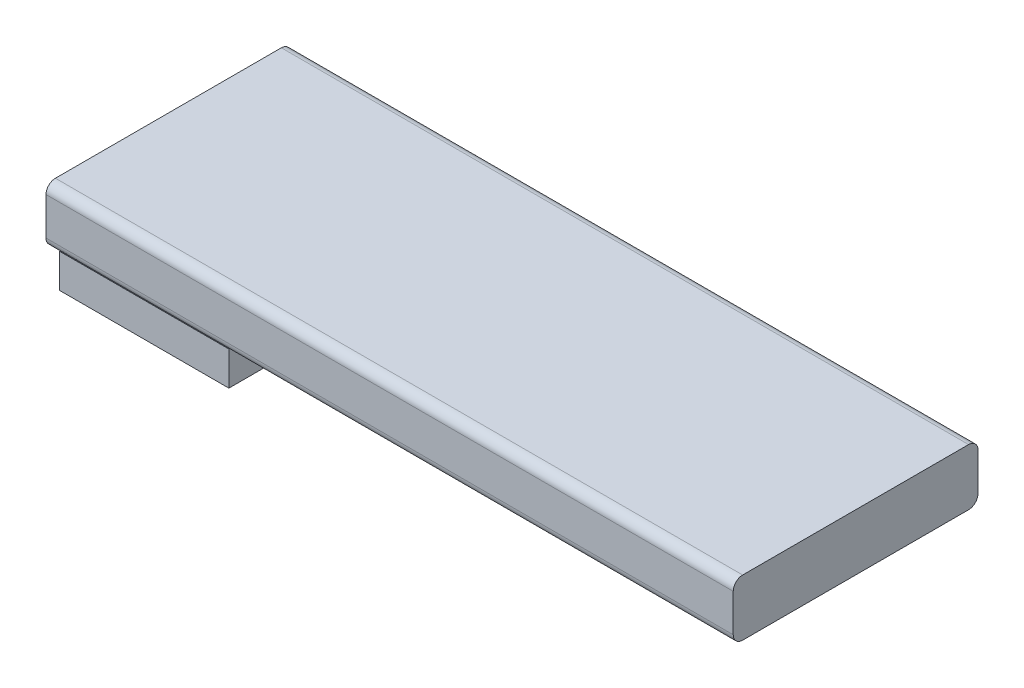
ISO-10303-21;
HEADER;
FILE_DESCRIPTION(('STEP AP214'),'2;1');
FILE_NAME('part.step','',(''),(''),'','','');
FILE_SCHEMA(('AUTOMOTIVE_DESIGN { 1 0 10303 214 1 1 1 1 }'));
ENDSEC;
DATA;
#1=APPLICATION_CONTEXT('core data for automotive mechanical design processes');
#2=APPLICATION_PROTOCOL_DEFINITION('international standard','automotive_design',2000,#1);
#3=PRODUCT_CONTEXT('',#1,'mechanical');
#4=PRODUCT('Part','Part','',(#3));
#5=PRODUCT_RELATED_PRODUCT_CATEGORY('part','',(#4));
#6=PRODUCT_DEFINITION_FORMATION('','',#4);
#7=PRODUCT_DEFINITION_CONTEXT('part definition',#1,'design');
#8=PRODUCT_DEFINITION('design','',#6,#7);
#9=PRODUCT_DEFINITION_SHAPE('','',#8);
#10=(LENGTH_UNIT() NAMED_UNIT(*) SI_UNIT(.MILLI.,.METRE.));
#11=(NAMED_UNIT(*) PLANE_ANGLE_UNIT() SI_UNIT($,.RADIAN.));
#12=(NAMED_UNIT(*) SI_UNIT($,.STERADIAN.) SOLID_ANGLE_UNIT());
#13=UNCERTAINTY_MEASURE_WITH_UNIT(LENGTH_MEASURE(1.E-05),#10,'distance_accuracy_value','');
#14=(GEOMETRIC_REPRESENTATION_CONTEXT(3) GLOBAL_UNCERTAINTY_ASSIGNED_CONTEXT((#13)) GLOBAL_UNIT_ASSIGNED_CONTEXT((#10,
#11,#12)) REPRESENTATION_CONTEXT('',''));
#15=CARTESIAN_POINT('',(0.,0.,0.));
#16=DIRECTION('',(0.,0.,1.));
#17=DIRECTION('',(1.,0.,0.));
#18=AXIS2_PLACEMENT_3D('',#15,#16,#17);
#19=CARTESIAN_POINT('',(73.,-3.,13.));
#20=DIRECTION('',(0.,1.,0.));
#21=DIRECTION('',(0.,0.,1.));
#22=AXIS2_PLACEMENT_3D('',#19,#20,#21);
#23=PLANE('',#22);
#24=DIRECTION('',(0.,0.,1.));
#25=VECTOR('',#24,1.);
#26=CARTESIAN_POINT('',(18.9272493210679,-3.,12.5));
#27=LINE('',#26,#25);
#28=CARTESIAN_POINT('',(18.9272493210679,-3.,-12.));
#29=VERTEX_POINT('',#28);
#30=CARTESIAN_POINT('',(18.9272493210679,-3.,12.));
#31=VERTEX_POINT('',#30);
#32=EDGE_CURVE('E203',#29,#31,#27,.T.);
#33=ORIENTED_EDGE('',*,*,#32,.F.);
#34=DIRECTION('',(-1.,0.,0.));
#35=VECTOR('',#34,1.);
#36=CARTESIAN_POINT('',(73.,-3.,-12.));
#37=LINE('',#36,#35);
#38=CARTESIAN_POINT('',(73.,-3.,-12.));
#39=VERTEX_POINT('',#38);
#40=EDGE_CURVE('E265',#29,#39,#37,.F.);
#41=ORIENTED_EDGE('',*,*,#40,.T.);
#42=DIRECTION('',(0.,0.,-1.));
#43=VECTOR('',#42,1.);
#44=CARTESIAN_POINT('',(73.,-3.,13.));
#45=LINE('',#44,#43);
#46=CARTESIAN_POINT('',(73.,-3.,12.));
#47=VERTEX_POINT('',#46);
#48=EDGE_CURVE('E235',#47,#39,#45,.T.);
#49=ORIENTED_EDGE('',*,*,#48,.F.);
#50=DIRECTION('',(-1.,0.,0.));
#51=VECTOR('',#50,1.);
#52=CARTESIAN_POINT('',(73.,-3.,12.));
#53=LINE('',#52,#51);
#54=EDGE_CURVE('E262',#47,#31,#53,.T.);
#55=ORIENTED_EDGE('',*,*,#54,.T.);
#56=EDGE_LOOP('',(#33,#41,#49,#55));
#57=FACE_BOUND('',#56,.T.);
#58=ADVANCED_FACE('F33',(#57),#23,.F.);
#59=DIRECTION('',(0.,0.,-1.));
#60=VECTOR('',#59,1.);
#61=CARTESIAN_POINT('',(0.927249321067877,-3.,12.5));
#62=LINE('',#61,#60);
#63=CARTESIAN_POINT('',(0.927249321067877,-3.,12.));
#64=VERTEX_POINT('',#63);
#65=CARTESIAN_POINT('',(0.927249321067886,-3.,-12.));
#66=VERTEX_POINT('',#65);
#67=EDGE_CURVE('E209',#64,#66,#62,.T.);
#68=ORIENTED_EDGE('',*,*,#67,.F.);
#69=CARTESIAN_POINT('',(0.,-3.,12.));
#70=VERTEX_POINT('',#69);
#71=EDGE_CURVE('E261',#64,#70,#53,.T.);
#72=ORIENTED_EDGE('',*,*,#71,.T.);
#73=DIRECTION('',(0.,0.,-1.));
#74=VECTOR('',#73,1.);
#75=CARTESIAN_POINT('',(0.,-3.,13.));
#76=LINE('',#75,#74);
#77=CARTESIAN_POINT('',(0.,-3.,-12.));
#78=VERTEX_POINT('',#77);
#79=EDGE_CURVE('E229',#70,#78,#76,.T.);
#80=ORIENTED_EDGE('',*,*,#79,.T.);
#81=EDGE_CURVE('E267',#78,#66,#37,.F.);
#82=ORIENTED_EDGE('',*,*,#81,.T.);
#83=EDGE_LOOP('',(#68,#72,#80,#82));
#84=FACE_BOUND('',#83,.T.);
#85=ADVANCED_FACE('F311',(#84),#23,.F.);
#86=CARTESIAN_POINT('',(73.,3.,-13.));
#87=DIRECTION('',(0.,0.,1.));
#88=DIRECTION('',(0.,-1.,0.));
#89=AXIS2_PLACEMENT_3D('',#86,#87,#88);
#90=PLANE('',#89);
#91=DIRECTION('',(0.,1.,0.));
#92=VECTOR('',#91,1.);
#93=CARTESIAN_POINT('',(73.,3.,-13.));
#94=LINE('',#93,#92);
#95=CARTESIAN_POINT('',(73.,-2.,-13.));
#96=VERTEX_POINT('',#95);
#97=CARTESIAN_POINT('',(73.,2.,-13.));
#98=VERTEX_POINT('',#97);
#99=EDGE_CURVE('E225',#96,#98,#94,.T.);
#100=ORIENTED_EDGE('',*,*,#99,.F.);
#101=DIRECTION('',(-1.,0.,0.));
#102=VECTOR('',#101,1.);
#103=CARTESIAN_POINT('',(73.,-2.,-13.));
#104=LINE('',#103,#102);
#105=CARTESIAN_POINT('',(0.,-2.,-13.));
#106=VERTEX_POINT('',#105);
#107=EDGE_CURVE('E250',#96,#106,#104,.T.);
#108=ORIENTED_EDGE('',*,*,#107,.T.);
#109=DIRECTION('',(0.,1.,0.));
#110=VECTOR('',#109,1.);
#111=CARTESIAN_POINT('',(0.,3.,-13.));
#112=LINE('',#111,#110);
#113=CARTESIAN_POINT('',(0.,2.,-13.));
#114=VERTEX_POINT('',#113);
#115=EDGE_CURVE('E224',#106,#114,#112,.T.);
#116=ORIENTED_EDGE('',*,*,#115,.T.);
#117=DIRECTION('',(-1.,0.,0.));
#118=VECTOR('',#117,1.);
#119=CARTESIAN_POINT('',(73.,2.,-13.));
#120=LINE('',#119,#118);
#121=EDGE_CURVE('E238',#114,#98,#120,.F.);
#122=ORIENTED_EDGE('',*,*,#121,.T.);
#123=EDGE_LOOP('',(#100,#108,#116,#122));
#124=FACE_BOUND('',#123,.T.);
#125=ADVANCED_FACE('F317',(#124),#90,.F.);
#126=CARTESIAN_POINT('',(73.,3.,13.));
#127=DIRECTION('',(0.,-1.,0.));
#128=DIRECTION('',(0.,0.,-1.));
#129=AXIS2_PLACEMENT_3D('',#126,#127,#128);
#130=PLANE('',#129);
#131=DIRECTION('',(0.,0.,1.));
#132=VECTOR('',#131,1.);
#133=CARTESIAN_POINT('',(73.,3.,13.));
#134=LINE('',#133,#132);
#135=CARTESIAN_POINT('',(73.,3.,-12.));
#136=VERTEX_POINT('',#135);
#137=CARTESIAN_POINT('',(73.,3.,12.));
#138=VERTEX_POINT('',#137);
#139=EDGE_CURVE('E228',#136,#138,#134,.T.);
#140=ORIENTED_EDGE('',*,*,#139,.F.);
#141=DIRECTION('',(-1.,0.,0.));
#142=VECTOR('',#141,1.);
#143=CARTESIAN_POINT('',(73.,3.,-12.));
#144=LINE('',#143,#142);
#145=CARTESIAN_POINT('',(0.,3.,-12.));
#146=VERTEX_POINT('',#145);
#147=EDGE_CURVE('E280',#136,#146,#144,.T.);
#148=ORIENTED_EDGE('',*,*,#147,.T.);
#149=DIRECTION('',(0.,0.,1.));
#150=VECTOR('',#149,1.);
#151=CARTESIAN_POINT('',(0.,3.,13.));
#152=LINE('',#151,#150);
#153=CARTESIAN_POINT('',(0.,3.,12.));
#154=VERTEX_POINT('',#153);
#155=EDGE_CURVE('E241',#146,#154,#152,.T.);
#156=ORIENTED_EDGE('',*,*,#155,.T.);
#157=DIRECTION('',(-1.,0.,0.));
#158=VECTOR('',#157,1.);
#159=CARTESIAN_POINT('',(73.,3.,12.));
#160=LINE('',#159,#158);
#161=EDGE_CURVE('E278',#154,#138,#160,.F.);
#162=ORIENTED_EDGE('',*,*,#161,.T.);
#163=EDGE_LOOP('',(#140,#148,#156,#162));
#164=FACE_BOUND('',#163,.T.);
#165=ADVANCED_FACE('F328',(#164),#130,.F.);
#166=CARTESIAN_POINT('',(73.,3.,13.));
#167=DIRECTION('',(0.,0.,-1.));
#168=DIRECTION('',(-1.,0.,0.));
#169=AXIS2_PLACEMENT_3D('',#166,#167,#168);
#170=PLANE('',#169);
#171=DIRECTION('',(0.,-1.,0.));
#172=VECTOR('',#171,1.);
#173=CARTESIAN_POINT('',(73.,3.,13.));
#174=LINE('',#173,#172);
#175=CARTESIAN_POINT('',(73.,2.,13.));
#176=VERTEX_POINT('',#175);
#177=CARTESIAN_POINT('',(73.,-2.,13.));
#178=VERTEX_POINT('',#177);
#179=EDGE_CURVE('E232',#176,#178,#174,.T.);
#180=ORIENTED_EDGE('',*,*,#179,.F.);
#181=DIRECTION('',(-1.,0.,0.));
#182=VECTOR('',#181,1.);
#183=CARTESIAN_POINT('',(73.,2.,13.));
#184=LINE('',#183,#182);
#185=CARTESIAN_POINT('',(0.,2.,13.));
#186=VERTEX_POINT('',#185);
#187=EDGE_CURVE('E285',#176,#186,#184,.T.);
#188=ORIENTED_EDGE('',*,*,#187,.T.);
#189=DIRECTION('',(0.,-1.,0.));
#190=VECTOR('',#189,1.);
#191=CARTESIAN_POINT('',(0.,3.,13.));
#192=LINE('',#191,#190);
#193=CARTESIAN_POINT('',(0.,-2.,13.));
#194=VERTEX_POINT('',#193);
#195=EDGE_CURVE('E244',#186,#194,#192,.T.);
#196=ORIENTED_EDGE('',*,*,#195,.T.);
#197=DIRECTION('',(-1.,0.,0.));
#198=VECTOR('',#197,1.);
#199=CARTESIAN_POINT('',(73.,-2.,13.));
#200=LINE('',#199,#198);
#201=EDGE_CURVE('E283',#194,#178,#200,.F.);
#202=ORIENTED_EDGE('',*,*,#201,.T.);
#203=EDGE_LOOP('',(#180,#188,#196,#202));
#204=FACE_BOUND('',#203,.T.);
#205=ADVANCED_FACE('F324',(#204),#170,.F.);
#206=CARTESIAN_POINT('',(73.,0.,0.));
#207=DIRECTION('',(1.,0.,0.));
#208=DIRECTION('',(0.,0.,-1.));
#209=AXIS2_PLACEMENT_3D('',#206,#207,#208);
#210=PLANE('',#209);
#211=ORIENTED_EDGE('',*,*,#48,.T.);
#212=CARTESIAN_POINT('',(73.,-2.,-12.));
#213=DIRECTION('',(1.,0.,0.));
#214=DIRECTION('',(0.,0.,-1.));
#215=AXIS2_PLACEMENT_3D('',#212,#213,#214);
#216=CIRCLE('',#215,1.);
#217=EDGE_CURVE('E276',#39,#96,#216,.T.);
#218=ORIENTED_EDGE('',*,*,#217,.T.);
#219=ORIENTED_EDGE('',*,*,#99,.T.);
#220=CARTESIAN_POINT('',(73.,2.,-12.));
#221=DIRECTION('',(1.,0.,0.));
#222=DIRECTION('',(0.,0.,-1.));
#223=AXIS2_PLACEMENT_3D('',#220,#221,#222);
#224=CIRCLE('',#223,1.);
#225=EDGE_CURVE('E274',#98,#136,#224,.T.);
#226=ORIENTED_EDGE('',*,*,#225,.T.);
#227=ORIENTED_EDGE('',*,*,#139,.T.);
#228=CARTESIAN_POINT('',(73.,2.,12.));
#229=DIRECTION('',(1.,0.,0.));
#230=DIRECTION('',(0.,0.,-1.));
#231=AXIS2_PLACEMENT_3D('',#228,#229,#230);
#232=CIRCLE('',#231,1.);
#233=EDGE_CURVE('E272',#138,#176,#232,.T.);
#234=ORIENTED_EDGE('',*,*,#233,.T.);
#235=ORIENTED_EDGE('',*,*,#179,.T.);
#236=CARTESIAN_POINT('',(73.,-2.,12.));
#237=DIRECTION('',(1.,0.,0.));
#238=DIRECTION('',(0.,0.,-1.));
#239=AXIS2_PLACEMENT_3D('',#236,#237,#238);
#240=CIRCLE('',#239,1.);
#241=EDGE_CURVE('E270',#178,#47,#240,.T.);
#242=ORIENTED_EDGE('',*,*,#241,.T.);
#243=EDGE_LOOP('',(#211,#218,#219,#226,#227,#234,#235,#242));
#244=FACE_BOUND('',#243,.T.);
#245=ADVANCED_FACE('F327',(#244),#210,.T.);
#246=CARTESIAN_POINT('',(0.,0.,0.));
#247=DIRECTION('',(1.,0.,0.));
#248=DIRECTION('',(0.,0.,-1.));
#249=AXIS2_PLACEMENT_3D('',#246,#247,#248);
#250=PLANE('',#249);
#251=ORIENTED_EDGE('',*,*,#115,.F.);
#252=CARTESIAN_POINT('',(0.,-2.,-12.));
#253=DIRECTION('',(1.,0.,0.));
#254=DIRECTION('',(0.,0.,-1.));
#255=AXIS2_PLACEMENT_3D('',#252,#253,#254);
#256=CIRCLE('',#255,1.);
#257=EDGE_CURVE('E259',#106,#78,#256,.F.);
#258=ORIENTED_EDGE('',*,*,#257,.T.);
#259=ORIENTED_EDGE('',*,*,#79,.F.);
#260=CARTESIAN_POINT('',(0.,-2.,12.));
#261=DIRECTION('',(1.,0.,0.));
#262=DIRECTION('',(0.,0.,-1.));
#263=AXIS2_PLACEMENT_3D('',#260,#261,#262);
#264=CIRCLE('',#263,1.);
#265=EDGE_CURVE('E253',#70,#194,#264,.F.);
#266=ORIENTED_EDGE('',*,*,#265,.T.);
#267=ORIENTED_EDGE('',*,*,#195,.F.);
#268=CARTESIAN_POINT('',(0.,2.,12.));
#269=DIRECTION('',(1.,0.,0.));
#270=DIRECTION('',(0.,0.,-1.));
#271=AXIS2_PLACEMENT_3D('',#268,#269,#270);
#272=CIRCLE('',#271,1.);
#273=EDGE_CURVE('E255',#186,#154,#272,.F.);
#274=ORIENTED_EDGE('',*,*,#273,.T.);
#275=ORIENTED_EDGE('',*,*,#155,.F.);
#276=CARTESIAN_POINT('',(0.,2.,-12.));
#277=DIRECTION('',(1.,0.,0.));
#278=DIRECTION('',(0.,0.,-1.));
#279=AXIS2_PLACEMENT_3D('',#276,#277,#278);
#280=CIRCLE('',#279,1.);
#281=EDGE_CURVE('E257',#146,#114,#280,.F.);
#282=ORIENTED_EDGE('',*,*,#281,.T.);
#283=EDGE_LOOP('',(#251,#258,#259,#266,#267,#274,#275,#282));
#284=FACE_BOUND('',#283,.T.);
#285=ADVANCED_FACE('F322',(#284),#250,.F.);
#286=CARTESIAN_POINT('',(73.,-2.,-12.));
#287=DIRECTION('',(-1.,0.,0.));
#288=DIRECTION('',(0.,0.,1.));
#289=AXIS2_PLACEMENT_3D('',#286,#287,#288);
#290=CYLINDRICAL_SURFACE('',#289,1.);
#291=ORIENTED_EDGE('',*,*,#217,.F.);
#292=ORIENTED_EDGE('',*,*,#40,.F.);
#293=DIRECTION('',(-1.,0.,0.));
#294=VECTOR('',#293,1.);
#295=CARTESIAN_POINT('',(73.,-3.,-12.));
#296=LINE('',#295,#294);
#297=EDGE_CURVE('E222',#66,#29,#296,.F.);
#298=ORIENTED_EDGE('',*,*,#297,.F.);
#299=ORIENTED_EDGE('',*,*,#81,.F.);
#300=ORIENTED_EDGE('',*,*,#257,.F.);
#301=ORIENTED_EDGE('',*,*,#107,.F.);
#302=EDGE_LOOP('',(#291,#292,#298,#299,#300,#301));
#303=FACE_BOUND('',#302,.T.);
#304=ADVANCED_FACE('F336',(#303),#290,.T.);
#305=CARTESIAN_POINT('',(73.,2.,-12.));
#306=DIRECTION('',(-1.,0.,0.));
#307=DIRECTION('',(0.,0.,1.));
#308=AXIS2_PLACEMENT_3D('',#305,#306,#307);
#309=CYLINDRICAL_SURFACE('',#308,1.);
#310=ORIENTED_EDGE('',*,*,#225,.F.);
#311=ORIENTED_EDGE('',*,*,#121,.F.);
#312=ORIENTED_EDGE('',*,*,#281,.F.);
#313=ORIENTED_EDGE('',*,*,#147,.F.);
#314=EDGE_LOOP('',(#310,#311,#312,#313));
#315=FACE_BOUND('',#314,.T.);
#316=ADVANCED_FACE('F339',(#315),#309,.T.);
#317=CARTESIAN_POINT('',(73.,2.,12.));
#318=DIRECTION('',(-1.,0.,0.));
#319=DIRECTION('',(0.,0.,1.));
#320=AXIS2_PLACEMENT_3D('',#317,#318,#319);
#321=CYLINDRICAL_SURFACE('',#320,1.);
#322=ORIENTED_EDGE('',*,*,#233,.F.);
#323=ORIENTED_EDGE('',*,*,#161,.F.);
#324=ORIENTED_EDGE('',*,*,#273,.F.);
#325=ORIENTED_EDGE('',*,*,#187,.F.);
#326=EDGE_LOOP('',(#322,#323,#324,#325));
#327=FACE_BOUND('',#326,.T.);
#328=ADVANCED_FACE('F342',(#327),#321,.T.);
#329=CARTESIAN_POINT('',(73.,-2.,12.));
#330=DIRECTION('',(-1.,0.,0.));
#331=DIRECTION('',(0.,0.,1.));
#332=AXIS2_PLACEMENT_3D('',#329,#330,#331);
#333=CYLINDRICAL_SURFACE('',#332,1.);
#334=ORIENTED_EDGE('',*,*,#241,.F.);
#335=ORIENTED_EDGE('',*,*,#201,.F.);
#336=ORIENTED_EDGE('',*,*,#265,.F.);
#337=ORIENTED_EDGE('',*,*,#71,.F.);
#338=EDGE_CURVE('E266',#31,#64,#53,.T.);
#339=ORIENTED_EDGE('',*,*,#338,.F.);
#340=ORIENTED_EDGE('',*,*,#54,.F.);
#341=EDGE_LOOP('',(#334,#335,#336,#337,#339,#340));
#342=FACE_BOUND('',#341,.T.);
#343=ADVANCED_FACE('F35',(#342),#333,.T.);
#344=CARTESIAN_POINT('',(0.,-3.,0.));
#345=DIRECTION('',(0.,-1.,0.));
#346=DIRECTION('',(0.,0.,-1.));
#347=AXIS2_PLACEMENT_3D('',#344,#345,#346);
#348=PLANE('',#347);
#349=ORIENTED_EDGE('',*,*,#297,.T.);
#350=CARTESIAN_POINT('',(18.9272493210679,-3.,-12.5));
#351=VERTEX_POINT('',#350);
#352=EDGE_CURVE('E199',#351,#29,#27,.T.);
#353=ORIENTED_EDGE('',*,*,#352,.F.);
#354=DIRECTION('',(1.,0.,0.));
#355=VECTOR('',#354,1.);
#356=CARTESIAN_POINT('',(0.92724932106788,-3.,-12.5));
#357=LINE('',#356,#355);
#358=CARTESIAN_POINT('',(0.92724932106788,-3.,-12.5));
#359=VERTEX_POINT('',#358);
#360=EDGE_CURVE('E191',#359,#351,#357,.T.);
#361=ORIENTED_EDGE('',*,*,#360,.F.);
#362=EDGE_CURVE('E205',#66,#359,#62,.T.);
#363=ORIENTED_EDGE('',*,*,#362,.F.);
#364=EDGE_LOOP('',(#349,#353,#361,#363));
#365=FACE_BOUND('',#364,.T.);
#366=ADVANCED_FACE('F306',(#365),#348,.F.);
#367=CARTESIAN_POINT('',(18.9272493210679,-6.6,12.5));
#368=DIRECTION('',(-1.,0.,0.));
#369=DIRECTION('',(0.,0.,1.));
#370=AXIS2_PLACEMENT_3D('',#367,#368,#369);
#371=PLANE('',#370);
#372=ORIENTED_EDGE('',*,*,#352,.T.);
#373=ORIENTED_EDGE('',*,*,#32,.T.);
#374=CARTESIAN_POINT('',(18.9272493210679,-3.,12.5));
#375=VERTEX_POINT('',#374);
#376=EDGE_CURVE('E185',#31,#375,#27,.T.);
#377=ORIENTED_EDGE('',*,*,#376,.T.);
#378=DIRECTION('',(0.,1.,0.));
#379=VECTOR('',#378,1.);
#380=CARTESIAN_POINT('',(18.9272493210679,-6.6,12.5));
#381=LINE('',#380,#379);
#382=CARTESIAN_POINT('',(18.9272493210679,-6.6,12.5));
#383=VERTEX_POINT('',#382);
#384=EDGE_CURVE('E219',#383,#375,#381,.T.);
#385=ORIENTED_EDGE('',*,*,#384,.F.);
#386=DIRECTION('',(0.,0.,1.));
#387=VECTOR('',#386,1.);
#388=CARTESIAN_POINT('',(18.9272493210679,-6.6,12.5));
#389=LINE('',#388,#387);
#390=CARTESIAN_POINT('',(18.9272493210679,-6.6,-12.5));
#391=VERTEX_POINT('',#390);
#392=EDGE_CURVE('E187',#391,#383,#389,.T.);
#393=ORIENTED_EDGE('',*,*,#392,.F.);
#394=DIRECTION('',(0.,1.,0.));
#395=VECTOR('',#394,1.);
#396=CARTESIAN_POINT('',(18.9272493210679,-6.6,-12.5));
#397=LINE('',#396,#395);
#398=EDGE_CURVE('E198',#391,#351,#397,.T.);
#399=ORIENTED_EDGE('',*,*,#398,.T.);
#400=EDGE_LOOP('',(#372,#373,#377,#385,#393,#399));
#401=FACE_BOUND('',#400,.T.);
#402=ADVANCED_FACE('F371',(#401),#371,.F.);
#403=CARTESIAN_POINT('',(0.927249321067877,-6.6,12.5));
#404=DIRECTION('',(0.,0.,-1.));
#405=DIRECTION('',(-1.,0.,0.));
#406=AXIS2_PLACEMENT_3D('',#403,#404,#405);
#407=PLANE('',#406);
#408=DIRECTION('',(-1.,0.,0.));
#409=VECTOR('',#408,1.);
#410=CARTESIAN_POINT('',(0.927249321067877,-3.,12.5));
#411=LINE('',#410,#409);
#412=CARTESIAN_POINT('',(0.927249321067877,-3.,12.5));
#413=VERTEX_POINT('',#412);
#414=EDGE_CURVE('E202',#375,#413,#411,.T.);
#415=ORIENTED_EDGE('',*,*,#414,.T.);
#416=DIRECTION('',(0.,1.,0.));
#417=VECTOR('',#416,1.);
#418=CARTESIAN_POINT('',(0.927249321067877,-6.6,12.5));
#419=LINE('',#418,#417);
#420=CARTESIAN_POINT('',(0.927249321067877,-6.6,12.5));
#421=VERTEX_POINT('',#420);
#422=EDGE_CURVE('E216',#421,#413,#419,.T.);
#423=ORIENTED_EDGE('',*,*,#422,.F.);
#424=DIRECTION('',(-1.,0.,0.));
#425=VECTOR('',#424,1.);
#426=CARTESIAN_POINT('',(0.927249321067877,-6.6,12.5));
#427=LINE('',#426,#425);
#428=EDGE_CURVE('E190',#383,#421,#427,.T.);
#429=ORIENTED_EDGE('',*,*,#428,.F.);
#430=ORIENTED_EDGE('',*,*,#384,.T.);
#431=EDGE_LOOP('',(#415,#423,#429,#430));
#432=FACE_BOUND('',#431,.T.);
#433=ADVANCED_FACE('F384',(#432),#407,.F.);
#434=CARTESIAN_POINT('',(0.927249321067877,-6.6,12.5));
#435=DIRECTION('',(1.,0.,0.));
#436=DIRECTION('',(0.,0.,-1.));
#437=AXIS2_PLACEMENT_3D('',#434,#435,#436);
#438=PLANE('',#437);
#439=EDGE_CURVE('E206',#413,#64,#62,.T.);
#440=ORIENTED_EDGE('',*,*,#439,.T.);
#441=ORIENTED_EDGE('',*,*,#67,.T.);
#442=ORIENTED_EDGE('',*,*,#362,.T.);
#443=DIRECTION('',(0.,1.,0.));
#444=VECTOR('',#443,1.);
#445=CARTESIAN_POINT('',(0.92724932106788,-6.6,-12.5));
#446=LINE('',#445,#444);
#447=CARTESIAN_POINT('',(0.92724932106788,-6.6,-12.5));
#448=VERTEX_POINT('',#447);
#449=EDGE_CURVE('E213',#448,#359,#446,.T.);
#450=ORIENTED_EDGE('',*,*,#449,.F.);
#451=DIRECTION('',(0.,0.,-1.));
#452=VECTOR('',#451,1.);
#453=CARTESIAN_POINT('',(0.927249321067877,-6.6,12.5));
#454=LINE('',#453,#452);
#455=EDGE_CURVE('E193',#421,#448,#454,.T.);
#456=ORIENTED_EDGE('',*,*,#455,.F.);
#457=ORIENTED_EDGE('',*,*,#422,.T.);
#458=EDGE_LOOP('',(#440,#441,#442,#450,#456,#457));
#459=FACE_BOUND('',#458,.T.);
#460=ADVANCED_FACE('F307',(#459),#438,.F.);
#461=CARTESIAN_POINT('',(0.92724932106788,-6.6,-12.5));
#462=DIRECTION('',(0.,0.,1.));
#463=DIRECTION('',(1.,0.,0.));
#464=AXIS2_PLACEMENT_3D('',#461,#462,#463);
#465=PLANE('',#464);
#466=ORIENTED_EDGE('',*,*,#360,.T.);
#467=ORIENTED_EDGE('',*,*,#398,.F.);
#468=DIRECTION('',(1.,0.,0.));
#469=VECTOR('',#468,1.);
#470=CARTESIAN_POINT('',(0.92724932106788,-6.6,-12.5));
#471=LINE('',#470,#469);
#472=CARTESIAN_POINT('',(13.9272493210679,-6.6,-12.5));
#473=VERTEX_POINT('',#472);
#474=EDGE_CURVE('E195',#473,#391,#471,.T.);
#475=ORIENTED_EDGE('',*,*,#474,.F.);
#476=DIRECTION('',(0.,-1.,0.));
#477=VECTOR('',#476,1.);
#478=CARTESIAN_POINT('',(13.9272493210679,-3.,-12.5));
#479=LINE('',#478,#477);
#480=CARTESIAN_POINT('',(13.9272493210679,-8.,-12.5));
#481=VERTEX_POINT('',#480);
#482=EDGE_CURVE('E180',#473,#481,#479,.T.);
#483=ORIENTED_EDGE('',*,*,#482,.T.);
#484=DIRECTION('',(-1.,0.,0.));
#485=VECTOR('',#484,1.);
#486=CARTESIAN_POINT('',(13.9272493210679,-8.,-12.5));
#487=LINE('',#486,#485);
#488=CARTESIAN_POINT('',(5.42724932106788,-8.,-12.5));
#489=VERTEX_POINT('',#488);
#490=EDGE_CURVE('E170',#481,#489,#487,.T.);
#491=ORIENTED_EDGE('',*,*,#490,.T.);
#492=DIRECTION('',(0.,1.,0.));
#493=VECTOR('',#492,1.);
#494=CARTESIAN_POINT('',(5.42724932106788,-3.,-12.5));
#495=LINE('',#494,#493);
#496=CARTESIAN_POINT('',(5.42724932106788,-6.6,-12.5));
#497=VERTEX_POINT('',#496);
#498=EDGE_CURVE('E164',#489,#497,#495,.T.);
#499=ORIENTED_EDGE('',*,*,#498,.T.);
#500=EDGE_CURVE('E196',#448,#497,#471,.T.);
#501=ORIENTED_EDGE('',*,*,#500,.F.);
#502=ORIENTED_EDGE('',*,*,#449,.T.);
#503=EDGE_LOOP('',(#466,#467,#475,#483,#491,#499,#501,#502));
#504=FACE_BOUND('',#503,.T.);
#505=ADVANCED_FACE('F293',(#504),#465,.F.);
#506=CARTESIAN_POINT('',(0.,-6.6,0.));
#507=DIRECTION('',(0.,-1.,0.));
#508=DIRECTION('',(0.,0.,-1.));
#509=AXIS2_PLACEMENT_3D('',#506,#507,#508);
#510=PLANE('',#509);
#511=DIRECTION('',(0.,0.,1.));
#512=VECTOR('',#511,1.);
#513=CARTESIAN_POINT('',(13.9272493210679,-6.6,0.));
#514=LINE('',#513,#512);
#515=CARTESIAN_POINT('',(13.9272493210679,-6.6,-2.5));
#516=VERTEX_POINT('',#515);
#517=EDGE_CURVE('E11',#473,#516,#514,.T.);
#518=ORIENTED_EDGE('',*,*,#517,.F.);
#519=ORIENTED_EDGE('',*,*,#474,.T.);
#520=ORIENTED_EDGE('',*,*,#392,.T.);
#521=ORIENTED_EDGE('',*,*,#428,.T.);
#522=ORIENTED_EDGE('',*,*,#455,.T.);
#523=ORIENTED_EDGE('',*,*,#500,.T.);
#524=DIRECTION('',(0.,0.,-1.));
#525=VECTOR('',#524,1.);
#526=CARTESIAN_POINT('',(5.42724932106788,-6.6,0.));
#527=LINE('',#526,#525);
#528=CARTESIAN_POINT('',(5.42724932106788,-6.6,-2.5));
#529=VERTEX_POINT('',#528);
#530=EDGE_CURVE('E41',#529,#497,#527,.T.);
#531=ORIENTED_EDGE('',*,*,#530,.F.);
#532=DIRECTION('',(1.,0.,0.));
#533=VECTOR('',#532,1.);
#534=CARTESIAN_POINT('',(0.,-6.6,-2.5));
#535=LINE('',#534,#533);
#536=EDGE_CURVE('E48',#529,#516,#535,.T.);
#537=ORIENTED_EDGE('',*,*,#536,.T.);
#538=EDGE_LOOP('',(#518,#519,#520,#521,#522,#523,#531,#537));
#539=FACE_BOUND('',#538,.T.);
#540=ADVANCED_FACE('F296',(#539),#510,.T.);
#541=ORIENTED_EDGE('',*,*,#338,.T.);
#542=ORIENTED_EDGE('',*,*,#439,.F.);
#543=ORIENTED_EDGE('',*,*,#414,.F.);
#544=ORIENTED_EDGE('',*,*,#376,.F.);
#545=EDGE_LOOP('',(#541,#542,#543,#544));
#546=FACE_BOUND('',#545,.T.);
#547=ADVANCED_FACE('F298',(#546),#348,.F.);
#548=CARTESIAN_POINT('',(13.9272493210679,-3.,-2.5));
#549=DIRECTION('',(1.,0.,0.));
#550=DIRECTION('',(0.,1.,0.));
#551=AXIS2_PLACEMENT_3D('',#548,#549,#550);
#552=PLANE('',#551);
#553=ORIENTED_EDGE('',*,*,#482,.F.);
#554=ORIENTED_EDGE('',*,*,#517,.T.);
#555=DIRECTION('',(0.,-1.,0.));
#556=VECTOR('',#555,1.);
#557=CARTESIAN_POINT('',(13.9272493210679,-3.,-2.5));
#558=LINE('',#557,#556);
#559=CARTESIAN_POINT('',(13.9272493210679,-8.,-2.5));
#560=VERTEX_POINT('',#559);
#561=EDGE_CURVE('E155',#516,#560,#558,.T.);
#562=ORIENTED_EDGE('',*,*,#561,.T.);
#563=DIRECTION('',(0.,0.,-1.));
#564=VECTOR('',#563,1.);
#565=CARTESIAN_POINT('',(13.9272493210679,-8.,-2.5));
#566=LINE('',#565,#564);
#567=EDGE_CURVE('E159',#560,#481,#566,.T.);
#568=ORIENTED_EDGE('',*,*,#567,.T.);
#569=EDGE_LOOP('',(#553,#554,#562,#568));
#570=FACE_BOUND('',#569,.T.);
#571=ADVANCED_FACE('F158',(#570),#552,.T.);
#572=CARTESIAN_POINT('',(5.42724932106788,-3.,-2.5));
#573=DIRECTION('',(-1.,0.,0.));
#574=DIRECTION('',(0.,-1.,0.));
#575=AXIS2_PLACEMENT_3D('',#572,#573,#574);
#576=PLANE('',#575);
#577=DIRECTION('',(0.,1.,0.));
#578=VECTOR('',#577,1.);
#579=CARTESIAN_POINT('',(5.42724932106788,-3.,-2.5));
#580=LINE('',#579,#578);
#581=CARTESIAN_POINT('',(5.42724932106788,-8.,-2.5));
#582=VERTEX_POINT('',#581);
#583=EDGE_CURVE('E172',#582,#529,#580,.T.);
#584=ORIENTED_EDGE('',*,*,#583,.T.);
#585=ORIENTED_EDGE('',*,*,#530,.T.);
#586=ORIENTED_EDGE('',*,*,#498,.F.);
#587=DIRECTION('',(0.,0.,-1.));
#588=VECTOR('',#587,1.);
#589=CARTESIAN_POINT('',(5.42724932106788,-8.,-2.5));
#590=LINE('',#589,#588);
#591=EDGE_CURVE('E171',#582,#489,#590,.T.);
#592=ORIENTED_EDGE('',*,*,#591,.F.);
#593=EDGE_LOOP('',(#584,#585,#586,#592));
#594=FACE_BOUND('',#593,.T.);
#595=ADVANCED_FACE('F290',(#594),#576,.T.);
#596=CARTESIAN_POINT('',(13.9272493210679,-8.,-2.5));
#597=DIRECTION('',(0.,-1.,0.));
#598=DIRECTION('',(1.,0.,0.));
#599=AXIS2_PLACEMENT_3D('',#596,#597,#598);
#600=PLANE('',#599);
#601=ORIENTED_EDGE('',*,*,#490,.F.);
#602=ORIENTED_EDGE('',*,*,#567,.F.);
#603=DIRECTION('',(-1.,0.,0.));
#604=VECTOR('',#603,1.);
#605=CARTESIAN_POINT('',(13.9272493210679,-8.,-2.5));
#606=LINE('',#605,#604);
#607=EDGE_CURVE('E163',#560,#582,#606,.T.);
#608=ORIENTED_EDGE('',*,*,#607,.T.);
#609=ORIENTED_EDGE('',*,*,#591,.T.);
#610=EDGE_LOOP('',(#601,#602,#608,#609));
#611=FACE_BOUND('',#610,.T.);
#612=ADVANCED_FACE('F168',(#611),#600,.T.);
#613=CARTESIAN_POINT('',(0.,0.,-2.5));
#614=DIRECTION('',(0.,0.,-1.));
#615=DIRECTION('',(-1.,0.,0.));
#616=AXIS2_PLACEMENT_3D('',#613,#614,#615);
#617=PLANE('',#616);
#618=ORIENTED_EDGE('',*,*,#536,.F.);
#619=ORIENTED_EDGE('',*,*,#583,.F.);
#620=ORIENTED_EDGE('',*,*,#607,.F.);
#621=ORIENTED_EDGE('',*,*,#561,.F.);
#622=EDGE_LOOP('',(#618,#619,#620,#621));
#623=FACE_BOUND('',#622,.T.);
#624=ADVANCED_FACE('F175',(#623),#617,.F.);
#625=CLOSED_SHELL('',(#58,#85,#125,#165,#205,#245,#285,#304,#316,#328,#343,#366,#402,#433,#460,
#505,#540,#547,#571,#595,#612,#624));
#626=MANIFOLD_SOLID_BREP('B2',#625);
#627=ADVANCED_BREP_SHAPE_REPRESENTATION('',(#18,#626),#14);
#628=SHAPE_DEFINITION_REPRESENTATION(#9,#627);
ENDSEC;
END-ISO-10303-21;
